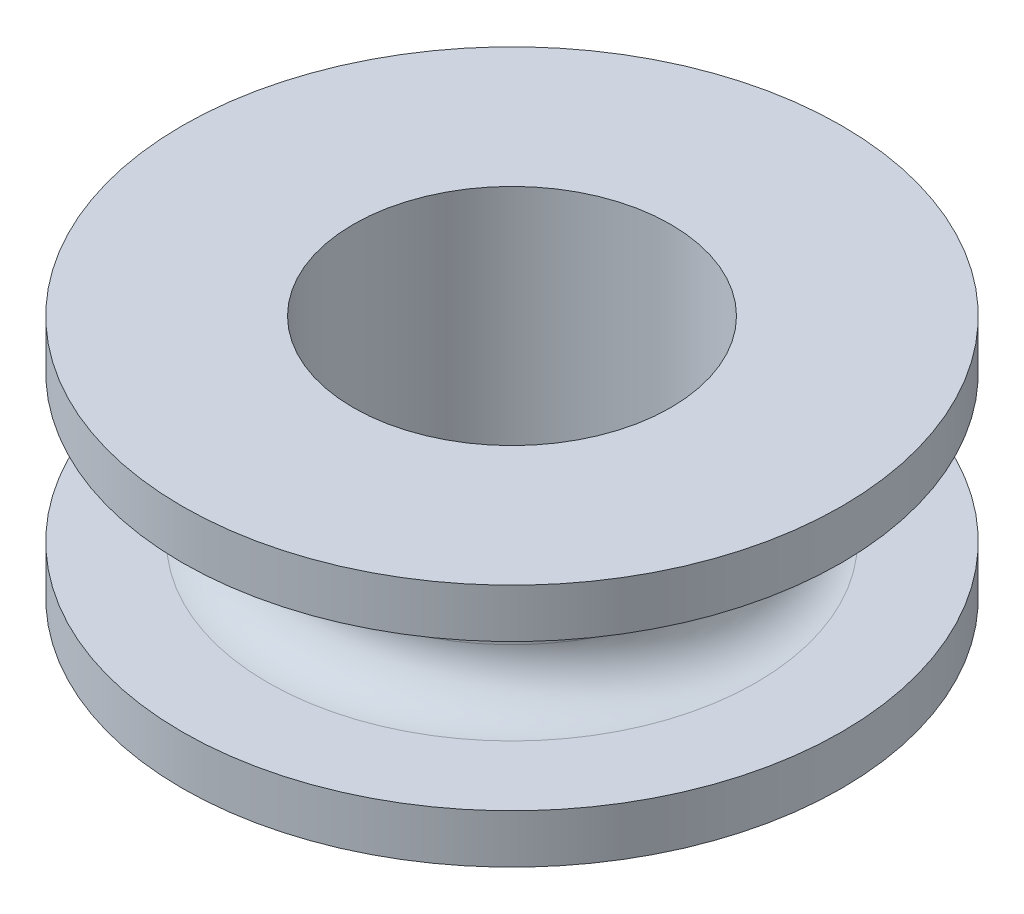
from build123d import *

# Parameters (mm, degrees)
SKETCH1_R           = 8
SKETCH1_R_2         = 6.5
BOSS_EXTRUDE1_DEPTH = 10
SKETCH2_W           = 5.5
SKETCH2_H           = 2
FILLET1_R           = 2


with BuildPart() as part:
    # Sketch1 → Boss-Extrude1 (new body)
    with BuildSketch(Plane(origin=(0, 0, 0), x_dir=(1, 0, 0), z_dir=(0, 1, 0))):
        with Locations(Location((0, 0, 0), (0, 0, 270))):
            Circle(SKETCH1_R)
        with Locations(Location((0, 0, 0), (0, 0, 270))):
            Circle(SKETCH1_R_2, mode=Mode.SUBTRACT)
    extrude(amount=BOSS_EXTRUDE1_DEPTH)

    # Sketch2 → Revolve1 (revolve)
    with BuildSketch(Plane.XY, mode=Mode.PRIVATE) as revolve1_sk:
        with Locations((10.75, 1)):
            Rectangle(SKETCH2_W, SKETCH2_H)
        with Locations((10.75, 9)):
            Rectangle(SKETCH2_W, SKETCH2_H)
    revolve(revolve1_sk.sketch.rotate(Axis((0, 10, 0), (0, -1, 0)), 90), axis=Axis((0, 10, 0), (0, -1, 0)))

    # Fillet1
    fillet1_edges = [part.edges().sort_by_distance(p)[0] for p in [
        (0, 8, -8),
        (0, 2, -8),
    ]]
    fillet(fillet1_edges, radius=FILLET1_R)


solid = part.part
